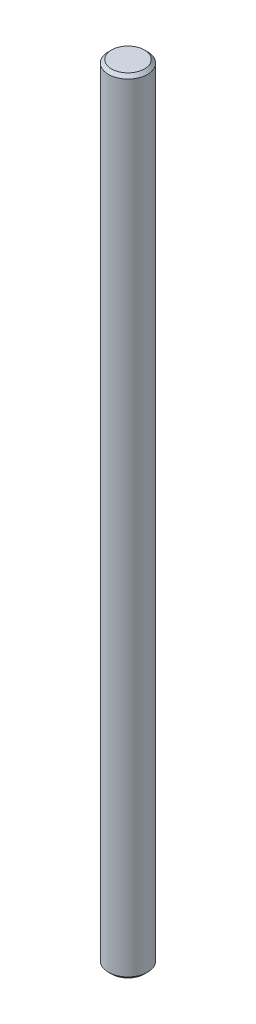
from build123d import *

# Parameters (mm, degrees)
SKETCH1_R      = 2.5
EXTRUDE1_DEPTH = 100
CHAMFER1_SIZE  = 0.4


with BuildPart() as part:
    # Sketch1 → Extrude1 (new body)
    with BuildSketch(Plane(origin=(0, 0, 0), x_dir=(1, 0, 0), z_dir=(0, 1, 0))):
        with Locations(Location((0, 0, 0), (0, 0, 270))):
            Circle(SKETCH1_R)
    extrude(amount=EXTRUDE1_DEPTH)

    # Chamfer1
    chamfer1_edges = [part.edges().sort_by_distance(p)[0] for p in [
        (0, 0, -2.5),
        (0, 100, -2.5),
    ]]
    chamfer(chamfer1_edges, length=CHAMFER1_SIZE)


solid = part.part
